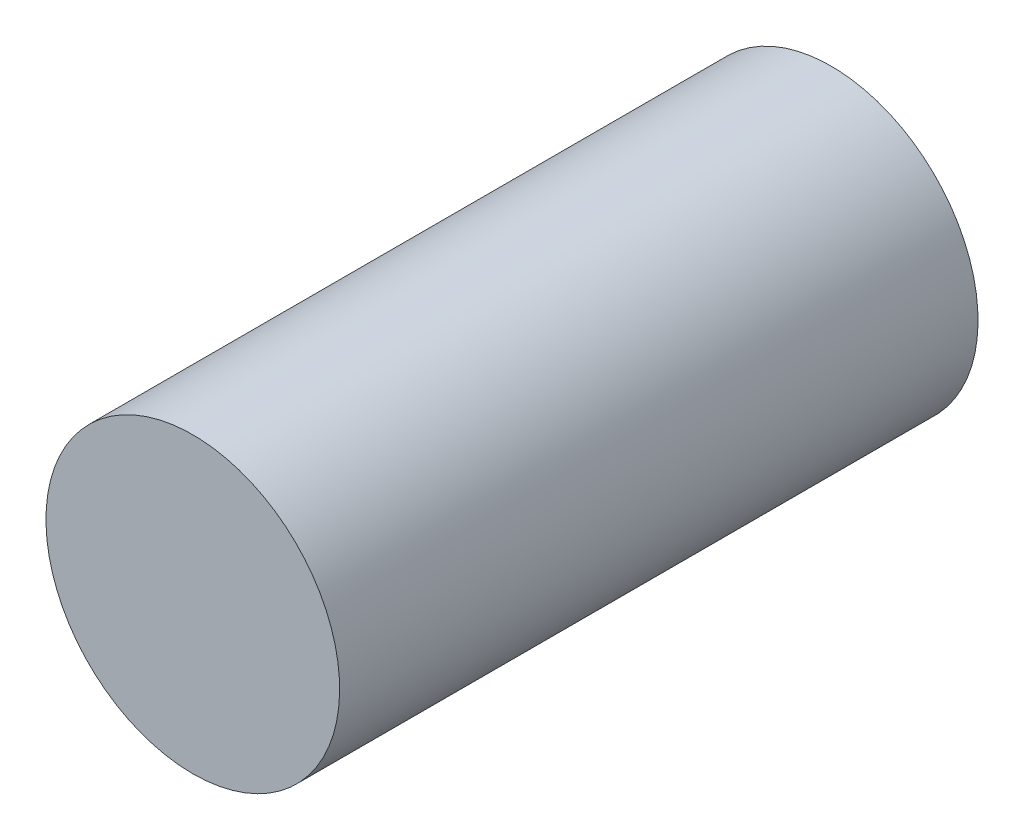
ISO-10303-21;
HEADER;
FILE_DESCRIPTION(('STEP AP214'),'2;1');
FILE_NAME('part.step','',(''),(''),'','','');
FILE_SCHEMA(('AUTOMOTIVE_DESIGN { 1 0 10303 214 1 1 1 1 }'));
ENDSEC;
DATA;
#1=APPLICATION_CONTEXT('core data for automotive mechanical design processes');
#2=APPLICATION_PROTOCOL_DEFINITION('international standard','automotive_design',2000,#1);
#3=PRODUCT_CONTEXT('',#1,'mechanical');
#4=PRODUCT('Part','Part','',(#3));
#5=PRODUCT_RELATED_PRODUCT_CATEGORY('part','',(#4));
#6=PRODUCT_DEFINITION_FORMATION('','',#4);
#7=PRODUCT_DEFINITION_CONTEXT('part definition',#1,'design');
#8=PRODUCT_DEFINITION('design','',#6,#7);
#9=PRODUCT_DEFINITION_SHAPE('','',#8);
#10=(LENGTH_UNIT() NAMED_UNIT(*) SI_UNIT(.MILLI.,.METRE.));
#11=(NAMED_UNIT(*) PLANE_ANGLE_UNIT() SI_UNIT($,.RADIAN.));
#12=(NAMED_UNIT(*) SI_UNIT($,.STERADIAN.) SOLID_ANGLE_UNIT());
#13=UNCERTAINTY_MEASURE_WITH_UNIT(LENGTH_MEASURE(1.E-05),#10,'distance_accuracy_value','');
#14=(GEOMETRIC_REPRESENTATION_CONTEXT(3) GLOBAL_UNCERTAINTY_ASSIGNED_CONTEXT((#13)) GLOBAL_UNIT_ASSIGNED_CONTEXT((#10,
#11,#12)) REPRESENTATION_CONTEXT('',''));
#15=CARTESIAN_POINT('',(0.,0.,0.));
#16=DIRECTION('',(0.,0.,1.));
#17=DIRECTION('',(1.,0.,0.));
#18=AXIS2_PLACEMENT_3D('',#15,#16,#17);
#19=CARTESIAN_POINT('',(0.,5.75,0.));
#20=DIRECTION('',(0.,0.,1.));
#21=DIRECTION('',(0.,-1.,0.));
#22=AXIS2_PLACEMENT_3D('',#19,#20,#21);
#23=PLANE('',#22);
#24=CARTESIAN_POINT('',(0.,0.,0.));
#25=DIRECTION('',(0.,0.,1.));
#26=DIRECTION('',(0.,-1.,0.));
#27=AXIS2_PLACEMENT_3D('',#24,#25,#26);
#28=CIRCLE('',#27,11.5);
#29=CARTESIAN_POINT('',(0.,-11.5,0.));
#30=VERTEX_POINT('',#29);
#31=EDGE_CURVE('E15',#30,#30,#28,.F.);
#32=ORIENTED_EDGE('',*,*,#31,.F.);
#33=EDGE_LOOP('',(#32));
#34=FACE_BOUND('',#33,.T.);
#35=ADVANCED_FACE('F12',(#34),#23,.T.);
#36=CARTESIAN_POINT('',(0.,5.75,-50.));
#37=DIRECTION('',(0.,0.,-1.));
#38=DIRECTION('',(0.,1.,0.));
#39=AXIS2_PLACEMENT_3D('',#36,#37,#38);
#40=PLANE('',#39);
#41=CARTESIAN_POINT('',(0.,0.,-50.));
#42=DIRECTION('',(0.,0.,1.));
#43=DIRECTION('',(0.,-1.,0.));
#44=AXIS2_PLACEMENT_3D('',#41,#42,#43);
#45=CIRCLE('',#44,11.5);
#46=CARTESIAN_POINT('',(0.,-11.5,-50.));
#47=VERTEX_POINT('',#46);
#48=EDGE_CURVE('E8',#47,#47,#45,.T.);
#49=ORIENTED_EDGE('',*,*,#48,.F.);
#50=EDGE_LOOP('',(#49));
#51=FACE_BOUND('',#50,.T.);
#52=ADVANCED_FACE('F27',(#51),#40,.T.);
#53=CARTESIAN_POINT('',(0.,0.,-25.));
#54=DIRECTION('',(0.,0.,1.));
#55=DIRECTION('',(0.,-1.,0.));
#56=AXIS2_PLACEMENT_3D('',#53,#54,#55);
#57=CYLINDRICAL_SURFACE('',#56,11.5);
#58=ORIENTED_EDGE('',*,*,#31,.T.);
#59=EDGE_LOOP('',(#58));
#60=FACE_BOUND('',#59,.T.);
#61=ORIENTED_EDGE('',*,*,#48,.T.);
#62=EDGE_LOOP('',(#61));
#63=FACE_BOUND('',#62,.T.);
#64=ADVANCED_FACE('F24',(#60,#63),#57,.T.);
#65=CLOSED_SHELL('',(#35,#52,#64));
#66=MANIFOLD_SOLID_BREP('B1',#65);
#67=ADVANCED_BREP_SHAPE_REPRESENTATION('',(#18,#66),#14);
#68=SHAPE_DEFINITION_REPRESENTATION(#9,#67);
ENDSEC;
END-ISO-10303-21;
